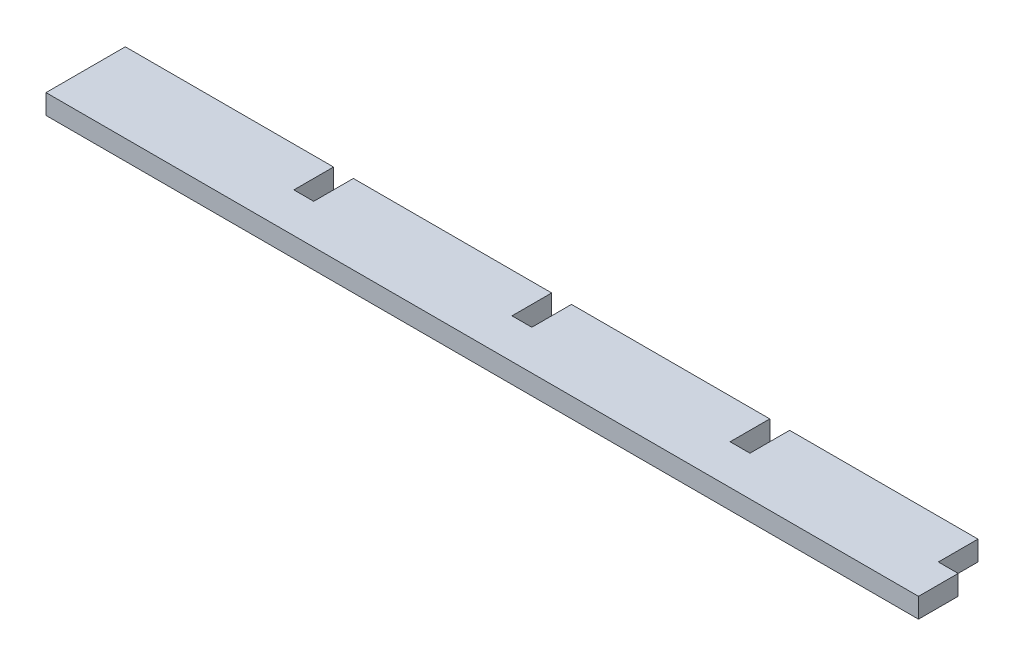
ISO-10303-21;
HEADER;
FILE_DESCRIPTION(('STEP AP214'),'2;1');
FILE_NAME('part.step','',(''),(''),'','','');
FILE_SCHEMA(('AUTOMOTIVE_DESIGN { 1 0 10303 214 1 1 1 1 }'));
ENDSEC;
DATA;
#1=APPLICATION_CONTEXT('core data for automotive mechanical design processes');
#2=APPLICATION_PROTOCOL_DEFINITION('international standard','automotive_design',2000,#1);
#3=PRODUCT_CONTEXT('',#1,'mechanical');
#4=PRODUCT('Part','Part','',(#3));
#5=PRODUCT_RELATED_PRODUCT_CATEGORY('part','',(#4));
#6=PRODUCT_DEFINITION_FORMATION('','',#4);
#7=PRODUCT_DEFINITION_CONTEXT('part definition',#1,'design');
#8=PRODUCT_DEFINITION('design','',#6,#7);
#9=PRODUCT_DEFINITION_SHAPE('','',#8);
#10=(LENGTH_UNIT() NAMED_UNIT(*) SI_UNIT(.MILLI.,.METRE.));
#11=(NAMED_UNIT(*) PLANE_ANGLE_UNIT() SI_UNIT($,.RADIAN.));
#12=(NAMED_UNIT(*) SI_UNIT($,.STERADIAN.) SOLID_ANGLE_UNIT());
#13=UNCERTAINTY_MEASURE_WITH_UNIT(LENGTH_MEASURE(1.E-05),#10,'distance_accuracy_value','');
#14=(GEOMETRIC_REPRESENTATION_CONTEXT(3) GLOBAL_UNCERTAINTY_ASSIGNED_CONTEXT((#13)) GLOBAL_UNIT_ASSIGNED_CONTEXT((#10,
#11,#12)) REPRESENTATION_CONTEXT('',''));
#15=CARTESIAN_POINT('',(0.,0.,0.));
#16=DIRECTION('',(0.,0.,1.));
#17=DIRECTION('',(1.,0.,0.));
#18=AXIS2_PLACEMENT_3D('',#15,#16,#17);
#19=CARTESIAN_POINT('',(0.,6.35,-25.4000000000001));
#20=DIRECTION('',(0.,0.,1.));
#21=DIRECTION('',(1.,0.,0.));
#22=AXIS2_PLACEMENT_3D('',#19,#20,#21);
#23=PLANE('',#22);
#24=DIRECTION('',(-1.,0.,0.));
#25=VECTOR('',#24,1.);
#26=CARTESIAN_POINT('',(0.,0.,-25.4000000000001));
#27=LINE('',#26,#25);
#28=CARTESIAN_POINT('',(-142.875,0.,-25.4));
#29=VERTEX_POINT('',#28);
#30=CARTESIAN_POINT('',(-206.375,0.,-25.4));
#31=VERTEX_POINT('',#30);
#32=EDGE_CURVE('E194',#29,#31,#27,.T.);
#33=ORIENTED_EDGE('',*,*,#32,.T.);
#34=DIRECTION('',(0.,-1.,0.));
#35=VECTOR('',#34,1.);
#36=CARTESIAN_POINT('',(-206.375,6.35,-25.4));
#37=LINE('',#36,#35);
#38=CARTESIAN_POINT('',(-206.375,6.35,-25.4));
#39=VERTEX_POINT('',#38);
#40=EDGE_CURVE('E11',#39,#31,#37,.T.);
#41=ORIENTED_EDGE('',*,*,#40,.F.);
#42=DIRECTION('',(-1.,0.,0.));
#43=VECTOR('',#42,1.);
#44=CARTESIAN_POINT('',(0.,6.35,-25.4000000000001));
#45=LINE('',#44,#43);
#46=CARTESIAN_POINT('',(-142.875,6.35,-25.4));
#47=VERTEX_POINT('',#46);
#48=EDGE_CURVE('E238',#47,#39,#45,.T.);
#49=ORIENTED_EDGE('',*,*,#48,.F.);
#50=DIRECTION('',(0.,-1.,0.));
#51=VECTOR('',#50,1.);
#52=CARTESIAN_POINT('',(-142.875,6.35,-25.4));
#53=LINE('',#52,#51);
#54=EDGE_CURVE('E52',#47,#29,#53,.T.);
#55=ORIENTED_EDGE('',*,*,#54,.T.);
#56=EDGE_LOOP('',(#33,#41,#49,#55));
#57=FACE_BOUND('',#56,.T.);
#58=ADVANCED_FACE('F35',(#57),#23,.F.);
#59=CARTESIAN_POINT('',(-206.375,6.35,0.));
#60=DIRECTION('',(1.,0.,0.));
#61=DIRECTION('',(0.,0.,-1.));
#62=AXIS2_PLACEMENT_3D('',#59,#60,#61);
#63=PLANE('',#62);
#64=DIRECTION('',(0.,0.,1.));
#65=VECTOR('',#64,1.);
#66=CARTESIAN_POINT('',(-206.375,0.,0.));
#67=LINE('',#66,#65);
#68=CARTESIAN_POINT('',(-206.375,0.,-12.7));
#69=VERTEX_POINT('',#68);
#70=EDGE_CURVE('E196',#31,#69,#67,.T.);
#71=ORIENTED_EDGE('',*,*,#70,.T.);
#72=DIRECTION('',(0.,-1.,0.));
#73=VECTOR('',#72,1.);
#74=CARTESIAN_POINT('',(-206.375,6.35,-12.7));
#75=LINE('',#74,#73);
#76=CARTESIAN_POINT('',(-206.375,6.35,-12.7));
#77=VERTEX_POINT('',#76);
#78=EDGE_CURVE('E44',#77,#69,#75,.T.);
#79=ORIENTED_EDGE('',*,*,#78,.F.);
#80=DIRECTION('',(0.,0.,1.));
#81=VECTOR('',#80,1.);
#82=CARTESIAN_POINT('',(-206.375,6.35,0.));
#83=LINE('',#82,#81);
#84=EDGE_CURVE('E120',#39,#77,#83,.T.);
#85=ORIENTED_EDGE('',*,*,#84,.F.);
#86=ORIENTED_EDGE('',*,*,#40,.T.);
#87=EDGE_LOOP('',(#71,#79,#85,#86));
#88=FACE_BOUND('',#87,.T.);
#89=ADVANCED_FACE('F37',(#88),#63,.F.);
#90=CARTESIAN_POINT('',(0.,6.35,-12.7));
#91=DIRECTION('',(0.,0.,-1.));
#92=DIRECTION('',(-1.,0.,0.));
#93=AXIS2_PLACEMENT_3D('',#90,#91,#92);
#94=PLANE('',#93);
#95=DIRECTION('',(1.,0.,0.));
#96=VECTOR('',#95,1.);
#97=CARTESIAN_POINT('',(0.,0.,-12.7));
#98=LINE('',#97,#96);
#99=CARTESIAN_POINT('',(-212.725,0.,-12.7));
#100=VERTEX_POINT('',#99);
#101=EDGE_CURVE('E201',#100,#69,#98,.T.);
#102=ORIENTED_EDGE('',*,*,#101,.F.);
#103=DIRECTION('',(0.,-1.,0.));
#104=VECTOR('',#103,1.);
#105=CARTESIAN_POINT('',(-212.725,6.35,-12.7));
#106=LINE('',#105,#104);
#107=CARTESIAN_POINT('',(-212.725,6.35,-12.7));
#108=VERTEX_POINT('',#107);
#109=EDGE_CURVE('E265',#108,#100,#106,.T.);
#110=ORIENTED_EDGE('',*,*,#109,.F.);
#111=DIRECTION('',(1.,0.,0.));
#112=VECTOR('',#111,1.);
#113=CARTESIAN_POINT('',(0.,6.35,-12.7));
#114=LINE('',#113,#112);
#115=EDGE_CURVE('E271',#108,#77,#114,.T.);
#116=ORIENTED_EDGE('',*,*,#115,.T.);
#117=ORIENTED_EDGE('',*,*,#78,.T.);
#118=EDGE_LOOP('',(#102,#110,#116,#117));
#119=FACE_BOUND('',#118,.T.);
#120=ADVANCED_FACE('F269',(#119),#94,.T.);
#121=CARTESIAN_POINT('',(-212.725,6.35,0.));
#122=DIRECTION('',(1.,0.,0.));
#123=DIRECTION('',(0.,0.,-1.));
#124=AXIS2_PLACEMENT_3D('',#121,#122,#123);
#125=PLANE('',#124);
#126=DIRECTION('',(0.,0.,1.));
#127=VECTOR('',#126,1.);
#128=CARTESIAN_POINT('',(-212.725,0.,0.));
#129=LINE('',#128,#127);
#130=CARTESIAN_POINT('',(-212.725,0.,-25.4));
#131=VERTEX_POINT('',#130);
#132=EDGE_CURVE('E204',#131,#100,#129,.T.);
#133=ORIENTED_EDGE('',*,*,#132,.F.);
#134=DIRECTION('',(0.,-1.,0.));
#135=VECTOR('',#134,1.);
#136=CARTESIAN_POINT('',(-212.725,6.35,-25.4));
#137=LINE('',#136,#135);
#138=CARTESIAN_POINT('',(-212.725,6.35,-25.4));
#139=VERTEX_POINT('',#138);
#140=EDGE_CURVE('E263',#139,#131,#137,.T.);
#141=ORIENTED_EDGE('',*,*,#140,.F.);
#142=DIRECTION('',(0.,0.,1.));
#143=VECTOR('',#142,1.);
#144=CARTESIAN_POINT('',(-212.725,6.35,0.));
#145=LINE('',#144,#143);
#146=EDGE_CURVE('E283',#139,#108,#145,.T.);
#147=ORIENTED_EDGE('',*,*,#146,.T.);
#148=ORIENTED_EDGE('',*,*,#109,.T.);
#149=EDGE_LOOP('',(#133,#141,#147,#148));
#150=FACE_BOUND('',#149,.T.);
#151=ADVANCED_FACE('F279',(#150),#125,.T.);
#152=CARTESIAN_POINT('',(-279.4,0.,-25.4));
#153=VERTEX_POINT('',#152);
#154=EDGE_CURVE('E198',#131,#153,#27,.T.);
#155=ORIENTED_EDGE('',*,*,#154,.T.);
#156=DIRECTION('',(0.,-1.,0.));
#157=VECTOR('',#156,1.);
#158=CARTESIAN_POINT('',(-279.4,6.35,-25.4));
#159=LINE('',#158,#157);
#160=CARTESIAN_POINT('',(-279.4,6.35,-25.4));
#161=VERTEX_POINT('',#160);
#162=EDGE_CURVE('E261',#161,#153,#159,.T.);
#163=ORIENTED_EDGE('',*,*,#162,.F.);
#164=EDGE_CURVE('E285',#139,#161,#45,.T.);
#165=ORIENTED_EDGE('',*,*,#164,.F.);
#166=ORIENTED_EDGE('',*,*,#140,.T.);
#167=EDGE_LOOP('',(#155,#163,#165,#166));
#168=FACE_BOUND('',#167,.T.);
#169=ADVANCED_FACE('F316',(#168),#23,.F.);
#170=CARTESIAN_POINT('',(-279.4,6.35,0.));
#171=DIRECTION('',(-1.,0.,0.));
#172=DIRECTION('',(0.,0.,1.));
#173=AXIS2_PLACEMENT_3D('',#170,#171,#172);
#174=PLANE('',#173);
#175=DIRECTION('',(0.,0.,-1.));
#176=VECTOR('',#175,1.);
#177=CARTESIAN_POINT('',(-279.4,0.,0.));
#178=LINE('',#177,#176);
#179=CARTESIAN_POINT('',(-279.4,0.,0.));
#180=VERTEX_POINT('',#179);
#181=EDGE_CURVE('E207',#180,#153,#178,.T.);
#182=ORIENTED_EDGE('',*,*,#181,.F.);
#183=DIRECTION('',(0.,-1.,0.));
#184=VECTOR('',#183,1.);
#185=CARTESIAN_POINT('',(-279.4,6.35,0.));
#186=LINE('',#185,#184);
#187=CARTESIAN_POINT('',(-279.4,6.35,0.));
#188=VERTEX_POINT('',#187);
#189=EDGE_CURVE('E259',#188,#180,#186,.T.);
#190=ORIENTED_EDGE('',*,*,#189,.F.);
#191=DIRECTION('',(0.,0.,-1.));
#192=VECTOR('',#191,1.);
#193=CARTESIAN_POINT('',(-279.4,6.35,0.));
#194=LINE('',#193,#192);
#195=EDGE_CURVE('E290',#188,#161,#194,.T.);
#196=ORIENTED_EDGE('',*,*,#195,.T.);
#197=ORIENTED_EDGE('',*,*,#162,.T.);
#198=EDGE_LOOP('',(#182,#190,#196,#197));
#199=FACE_BOUND('',#198,.T.);
#200=ADVANCED_FACE('F319',(#199),#174,.T.);
#201=CARTESIAN_POINT('',(0.,6.35,0.));
#202=DIRECTION('',(0.,0.,1.));
#203=DIRECTION('',(1.,0.,0.));
#204=AXIS2_PLACEMENT_3D('',#201,#202,#203);
#205=PLANE('',#204);
#206=DIRECTION('',(-1.,0.,0.));
#207=VECTOR('',#206,1.);
#208=CARTESIAN_POINT('',(0.,0.,0.));
#209=LINE('',#208,#207);
#210=CARTESIAN_POINT('',(0.,0.,0.));
#211=VERTEX_POINT('',#210);
#212=EDGE_CURVE('E210',#211,#180,#209,.T.);
#213=ORIENTED_EDGE('',*,*,#212,.F.);
#214=DIRECTION('',(0.,-1.,0.));
#215=VECTOR('',#214,1.);
#216=CARTESIAN_POINT('',(0.,6.35,0.));
#217=LINE('',#216,#215);
#218=CARTESIAN_POINT('',(0.,6.35,0.));
#219=VERTEX_POINT('',#218);
#220=EDGE_CURVE('E257',#219,#211,#217,.T.);
#221=ORIENTED_EDGE('',*,*,#220,.F.);
#222=DIRECTION('',(-1.,0.,0.));
#223=VECTOR('',#222,1.);
#224=CARTESIAN_POINT('',(0.,6.35,0.));
#225=LINE('',#224,#223);
#226=EDGE_CURVE('E293',#219,#188,#225,.T.);
#227=ORIENTED_EDGE('',*,*,#226,.T.);
#228=ORIENTED_EDGE('',*,*,#189,.T.);
#229=EDGE_LOOP('',(#213,#221,#227,#228));
#230=FACE_BOUND('',#229,.T.);
#231=ADVANCED_FACE('F322',(#230),#205,.T.);
#232=CARTESIAN_POINT('',(0.,6.35,0.));
#233=DIRECTION('',(-1.,0.,0.));
#234=DIRECTION('',(0.,0.,1.));
#235=AXIS2_PLACEMENT_3D('',#232,#233,#234);
#236=PLANE('',#235);
#237=DIRECTION('',(0.,0.,-1.));
#238=VECTOR('',#237,1.);
#239=CARTESIAN_POINT('',(0.,0.,0.));
#240=LINE('',#239,#238);
#241=CARTESIAN_POINT('',(0.,0.,-12.7));
#242=VERTEX_POINT('',#241);
#243=EDGE_CURVE('E213',#211,#242,#240,.T.);
#244=ORIENTED_EDGE('',*,*,#243,.T.);
#245=DIRECTION('',(0.,-1.,0.));
#246=VECTOR('',#245,1.);
#247=CARTESIAN_POINT('',(0.,6.35,-12.7));
#248=LINE('',#247,#246);
#249=CARTESIAN_POINT('',(0.,6.35,-12.7));
#250=VERTEX_POINT('',#249);
#251=EDGE_CURVE('E255',#250,#242,#248,.T.);
#252=ORIENTED_EDGE('',*,*,#251,.F.);
#253=DIRECTION('',(0.,0.,-1.));
#254=VECTOR('',#253,1.);
#255=CARTESIAN_POINT('',(0.,6.35,0.));
#256=LINE('',#255,#254);
#257=EDGE_CURVE('E296',#219,#250,#256,.T.);
#258=ORIENTED_EDGE('',*,*,#257,.F.);
#259=ORIENTED_EDGE('',*,*,#220,.T.);
#260=EDGE_LOOP('',(#244,#252,#258,#259));
#261=FACE_BOUND('',#260,.T.);
#262=ADVANCED_FACE('F328',(#261),#236,.F.);
#263=CARTESIAN_POINT('',(0.,6.35,-12.7));
#264=DIRECTION('',(0.,0.,-1.));
#265=DIRECTION('',(-1.,0.,0.));
#266=AXIS2_PLACEMENT_3D('',#263,#264,#265);
#267=PLANE('',#266);
#268=DIRECTION('',(1.,0.,0.));
#269=VECTOR('',#268,1.);
#270=CARTESIAN_POINT('',(0.,0.,-12.7));
#271=LINE('',#270,#269);
#272=CARTESIAN_POINT('',(-6.35,0.,-12.7));
#273=VERTEX_POINT('',#272);
#274=EDGE_CURVE('E216',#273,#242,#271,.T.);
#275=ORIENTED_EDGE('',*,*,#274,.F.);
#276=DIRECTION('',(0.,-1.,0.));
#277=VECTOR('',#276,1.);
#278=CARTESIAN_POINT('',(-6.35,6.35,-12.7));
#279=LINE('',#278,#277);
#280=CARTESIAN_POINT('',(-6.35,6.35,-12.7));
#281=VERTEX_POINT('',#280);
#282=EDGE_CURVE('E253',#281,#273,#279,.T.);
#283=ORIENTED_EDGE('',*,*,#282,.F.);
#284=DIRECTION('',(1.,0.,0.));
#285=VECTOR('',#284,1.);
#286=CARTESIAN_POINT('',(0.,6.35,-12.7));
#287=LINE('',#286,#285);
#288=EDGE_CURVE('E298',#281,#250,#287,.T.);
#289=ORIENTED_EDGE('',*,*,#288,.T.);
#290=ORIENTED_EDGE('',*,*,#251,.T.);
#291=EDGE_LOOP('',(#275,#283,#289,#290));
#292=FACE_BOUND('',#291,.T.);
#293=ADVANCED_FACE('F332',(#292),#267,.T.);
#294=CARTESIAN_POINT('',(-6.35,6.35,0.));
#295=DIRECTION('',(1.,0.,0.));
#296=DIRECTION('',(0.,0.,-1.));
#297=AXIS2_PLACEMENT_3D('',#294,#295,#296);
#298=PLANE('',#297);
#299=DIRECTION('',(0.,0.,1.));
#300=VECTOR('',#299,1.);
#301=CARTESIAN_POINT('',(-6.35,0.,0.));
#302=LINE('',#301,#300);
#303=CARTESIAN_POINT('',(-6.35,0.,-25.4000000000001));
#304=VERTEX_POINT('',#303);
#305=EDGE_CURVE('E219',#304,#273,#302,.T.);
#306=ORIENTED_EDGE('',*,*,#305,.F.);
#307=DIRECTION('',(0.,-1.,0.));
#308=VECTOR('',#307,1.);
#309=CARTESIAN_POINT('',(-6.35,6.35,-25.4000000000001));
#310=LINE('',#309,#308);
#311=CARTESIAN_POINT('',(-6.35,6.35,-25.4000000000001));
#312=VERTEX_POINT('',#311);
#313=EDGE_CURVE('E251',#312,#304,#310,.T.);
#314=ORIENTED_EDGE('',*,*,#313,.F.);
#315=DIRECTION('',(0.,0.,1.));
#316=VECTOR('',#315,1.);
#317=CARTESIAN_POINT('',(-6.35,6.35,0.));
#318=LINE('',#317,#316);
#319=EDGE_CURVE('E301',#312,#281,#318,.T.);
#320=ORIENTED_EDGE('',*,*,#319,.T.);
#321=ORIENTED_EDGE('',*,*,#282,.T.);
#322=EDGE_LOOP('',(#306,#314,#320,#321));
#323=FACE_BOUND('',#322,.T.);
#324=ADVANCED_FACE('F335',(#323),#298,.T.);
#325=CARTESIAN_POINT('',(-66.675,0.,-25.4));
#326=VERTEX_POINT('',#325);
#327=EDGE_CURVE('E222',#304,#326,#27,.T.);
#328=ORIENTED_EDGE('',*,*,#327,.T.);
#329=DIRECTION('',(0.,-1.,0.));
#330=VECTOR('',#329,1.);
#331=CARTESIAN_POINT('',(-66.675,6.35,-25.4));
#332=LINE('',#331,#330);
#333=CARTESIAN_POINT('',(-66.675,6.35,-25.4));
#334=VERTEX_POINT('',#333);
#335=EDGE_CURVE('E248',#334,#326,#332,.T.);
#336=ORIENTED_EDGE('',*,*,#335,.F.);
#337=EDGE_CURVE('E304',#312,#334,#45,.T.);
#338=ORIENTED_EDGE('',*,*,#337,.F.);
#339=ORIENTED_EDGE('',*,*,#313,.T.);
#340=EDGE_LOOP('',(#328,#336,#338,#339));
#341=FACE_BOUND('',#340,.T.);
#342=ADVANCED_FACE('F342',(#341),#23,.F.);
#343=CARTESIAN_POINT('',(-66.675,6.35,0.));
#344=DIRECTION('',(1.,0.,0.));
#345=DIRECTION('',(0.,0.,-1.));
#346=AXIS2_PLACEMENT_3D('',#343,#344,#345);
#347=PLANE('',#346);
#348=DIRECTION('',(0.,0.,1.));
#349=VECTOR('',#348,1.);
#350=CARTESIAN_POINT('',(-66.675,0.,0.));
#351=LINE('',#350,#349);
#352=CARTESIAN_POINT('',(-66.675,0.,-12.7));
#353=VERTEX_POINT('',#352);
#354=EDGE_CURVE('E223',#326,#353,#351,.T.);
#355=ORIENTED_EDGE('',*,*,#354,.T.);
#356=DIRECTION('',(0.,-1.,0.));
#357=VECTOR('',#356,1.);
#358=CARTESIAN_POINT('',(-66.675,6.35,-12.7));
#359=LINE('',#358,#357);
#360=CARTESIAN_POINT('',(-66.675,6.35,-12.7));
#361=VERTEX_POINT('',#360);
#362=EDGE_CURVE('E246',#361,#353,#359,.T.);
#363=ORIENTED_EDGE('',*,*,#362,.F.);
#364=DIRECTION('',(0.,0.,1.));
#365=VECTOR('',#364,1.);
#366=CARTESIAN_POINT('',(-66.675,6.35,0.));
#367=LINE('',#366,#365);
#368=EDGE_CURVE('E305',#334,#361,#367,.T.);
#369=ORIENTED_EDGE('',*,*,#368,.F.);
#370=ORIENTED_EDGE('',*,*,#335,.T.);
#371=EDGE_LOOP('',(#355,#363,#369,#370));
#372=FACE_BOUND('',#371,.T.);
#373=ADVANCED_FACE('F346',(#372),#347,.F.);
#374=CARTESIAN_POINT('',(0.,6.35,-12.7));
#375=DIRECTION('',(0.,0.,-1.));
#376=DIRECTION('',(-1.,0.,0.));
#377=AXIS2_PLACEMENT_3D('',#374,#375,#376);
#378=PLANE('',#377);
#379=DIRECTION('',(1.,0.,0.));
#380=VECTOR('',#379,1.);
#381=CARTESIAN_POINT('',(0.,0.,-12.7));
#382=LINE('',#381,#380);
#383=CARTESIAN_POINT('',(-73.025,0.,-12.7));
#384=VERTEX_POINT('',#383);
#385=EDGE_CURVE('E226',#384,#353,#382,.T.);
#386=ORIENTED_EDGE('',*,*,#385,.F.);
#387=DIRECTION('',(0.,-1.,0.));
#388=VECTOR('',#387,1.);
#389=CARTESIAN_POINT('',(-73.025,6.35,-12.7));
#390=LINE('',#389,#388);
#391=CARTESIAN_POINT('',(-73.025,6.35,-12.7));
#392=VERTEX_POINT('',#391);
#393=EDGE_CURVE('E244',#392,#384,#390,.T.);
#394=ORIENTED_EDGE('',*,*,#393,.F.);
#395=DIRECTION('',(1.,0.,0.));
#396=VECTOR('',#395,1.);
#397=CARTESIAN_POINT('',(0.,6.35,-12.7));
#398=LINE('',#397,#396);
#399=EDGE_CURVE('E307',#392,#361,#398,.T.);
#400=ORIENTED_EDGE('',*,*,#399,.T.);
#401=ORIENTED_EDGE('',*,*,#362,.T.);
#402=EDGE_LOOP('',(#386,#394,#400,#401));
#403=FACE_BOUND('',#402,.T.);
#404=ADVANCED_FACE('F349',(#403),#378,.T.);
#405=CARTESIAN_POINT('',(-73.025,6.35,0.));
#406=DIRECTION('',(1.,0.,0.));
#407=DIRECTION('',(0.,0.,-1.));
#408=AXIS2_PLACEMENT_3D('',#405,#406,#407);
#409=PLANE('',#408);
#410=DIRECTION('',(0.,0.,1.));
#411=VECTOR('',#410,1.);
#412=CARTESIAN_POINT('',(-73.025,0.,0.));
#413=LINE('',#412,#411);
#414=CARTESIAN_POINT('',(-73.025,0.,-25.4));
#415=VERTEX_POINT('',#414);
#416=EDGE_CURVE('E229',#415,#384,#413,.T.);
#417=ORIENTED_EDGE('',*,*,#416,.F.);
#418=DIRECTION('',(0.,-1.,0.));
#419=VECTOR('',#418,1.);
#420=CARTESIAN_POINT('',(-73.025,6.35,-25.4));
#421=LINE('',#420,#419);
#422=CARTESIAN_POINT('',(-73.025,6.35,-25.4));
#423=VERTEX_POINT('',#422);
#424=EDGE_CURVE('E242',#423,#415,#421,.T.);
#425=ORIENTED_EDGE('',*,*,#424,.F.);
#426=DIRECTION('',(0.,0.,1.));
#427=VECTOR('',#426,1.);
#428=CARTESIAN_POINT('',(-73.025,6.35,0.));
#429=LINE('',#428,#427);
#430=EDGE_CURVE('E309',#423,#392,#429,.T.);
#431=ORIENTED_EDGE('',*,*,#430,.T.);
#432=ORIENTED_EDGE('',*,*,#393,.T.);
#433=EDGE_LOOP('',(#417,#425,#431,#432));
#434=FACE_BOUND('',#433,.T.);
#435=ADVANCED_FACE('F351',(#434),#409,.T.);
#436=CARTESIAN_POINT('',(-136.525,0.,-25.4));
#437=VERTEX_POINT('',#436);
#438=EDGE_CURVE('E197',#415,#437,#27,.T.);
#439=ORIENTED_EDGE('',*,*,#438,.T.);
#440=DIRECTION('',(0.,-1.,0.));
#441=VECTOR('',#440,1.);
#442=CARTESIAN_POINT('',(-136.525,6.35,-25.4));
#443=LINE('',#442,#441);
#444=CARTESIAN_POINT('',(-136.525,6.35,-25.4));
#445=VERTEX_POINT('',#444);
#446=EDGE_CURVE('E186',#445,#437,#443,.T.);
#447=ORIENTED_EDGE('',*,*,#446,.F.);
#448=EDGE_CURVE('E174',#423,#445,#45,.T.);
#449=ORIENTED_EDGE('',*,*,#448,.F.);
#450=ORIENTED_EDGE('',*,*,#424,.T.);
#451=EDGE_LOOP('',(#439,#447,#449,#450));
#452=FACE_BOUND('',#451,.T.);
#453=ADVANCED_FACE('F354',(#452),#23,.F.);
#454=CARTESIAN_POINT('',(-136.525,6.35,0.));
#455=DIRECTION('',(1.,0.,0.));
#456=DIRECTION('',(0.,0.,-1.));
#457=AXIS2_PLACEMENT_3D('',#454,#455,#456);
#458=PLANE('',#457);
#459=DIRECTION('',(0.,0.,1.));
#460=VECTOR('',#459,1.);
#461=CARTESIAN_POINT('',(-136.525,0.,0.));
#462=LINE('',#461,#460);
#463=CARTESIAN_POINT('',(-136.525,0.,-12.7));
#464=VERTEX_POINT('',#463);
#465=EDGE_CURVE('E183',#437,#464,#462,.T.);
#466=ORIENTED_EDGE('',*,*,#465,.T.);
#467=DIRECTION('',(0.,-1.,0.));
#468=VECTOR('',#467,1.);
#469=CARTESIAN_POINT('',(-136.525,6.35,-12.7));
#470=LINE('',#469,#468);
#471=CARTESIAN_POINT('',(-136.525,6.35,-12.7));
#472=VERTEX_POINT('',#471);
#473=EDGE_CURVE('E180',#472,#464,#470,.T.);
#474=ORIENTED_EDGE('',*,*,#473,.F.);
#475=DIRECTION('',(0.,0.,1.));
#476=VECTOR('',#475,1.);
#477=CARTESIAN_POINT('',(-136.525,6.35,0.));
#478=LINE('',#477,#476);
#479=EDGE_CURVE('E166',#445,#472,#478,.T.);
#480=ORIENTED_EDGE('',*,*,#479,.F.);
#481=ORIENTED_EDGE('',*,*,#446,.T.);
#482=EDGE_LOOP('',(#466,#474,#480,#481));
#483=FACE_BOUND('',#482,.T.);
#484=ADVANCED_FACE('F181',(#483),#458,.F.);
#485=CARTESIAN_POINT('',(0.,6.35,-12.7));
#486=DIRECTION('',(0.,0.,-1.));
#487=DIRECTION('',(-1.,0.,0.));
#488=AXIS2_PLACEMENT_3D('',#485,#486,#487);
#489=PLANE('',#488);
#490=DIRECTION('',(1.,0.,0.));
#491=VECTOR('',#490,1.);
#492=CARTESIAN_POINT('',(0.,0.,-12.7));
#493=LINE('',#492,#491);
#494=CARTESIAN_POINT('',(-142.875,0.,-12.7));
#495=VERTEX_POINT('',#494);
#496=EDGE_CURVE('E233',#495,#464,#493,.T.);
#497=ORIENTED_EDGE('',*,*,#496,.F.);
#498=DIRECTION('',(0.,-1.,0.));
#499=VECTOR('',#498,1.);
#500=CARTESIAN_POINT('',(-142.875,6.35,-12.7));
#501=LINE('',#500,#499);
#502=CARTESIAN_POINT('',(-142.875,6.35,-12.7));
#503=VERTEX_POINT('',#502);
#504=EDGE_CURVE('E108',#503,#495,#501,.T.);
#505=ORIENTED_EDGE('',*,*,#504,.F.);
#506=DIRECTION('',(1.,0.,0.));
#507=VECTOR('',#506,1.);
#508=CARTESIAN_POINT('',(0.,6.35,-12.7));
#509=LINE('',#508,#507);
#510=EDGE_CURVE('E171',#503,#472,#509,.T.);
#511=ORIENTED_EDGE('',*,*,#510,.T.);
#512=ORIENTED_EDGE('',*,*,#473,.T.);
#513=EDGE_LOOP('',(#497,#505,#511,#512));
#514=FACE_BOUND('',#513,.T.);
#515=ADVANCED_FACE('F188',(#514),#489,.T.);
#516=CARTESIAN_POINT('',(-142.875,6.35,0.));
#517=DIRECTION('',(1.,0.,0.));
#518=DIRECTION('',(0.,0.,-1.));
#519=AXIS2_PLACEMENT_3D('',#516,#517,#518);
#520=PLANE('',#519);
#521=DIRECTION('',(0.,0.,1.));
#522=VECTOR('',#521,1.);
#523=CARTESIAN_POINT('',(-142.875,0.,0.));
#524=LINE('',#523,#522);
#525=EDGE_CURVE('E235',#29,#495,#524,.T.);
#526=ORIENTED_EDGE('',*,*,#525,.F.);
#527=ORIENTED_EDGE('',*,*,#54,.F.);
#528=DIRECTION('',(0.,0.,1.));
#529=VECTOR('',#528,1.);
#530=CARTESIAN_POINT('',(-142.875,6.35,0.));
#531=LINE('',#530,#529);
#532=EDGE_CURVE('E189',#47,#503,#531,.T.);
#533=ORIENTED_EDGE('',*,*,#532,.T.);
#534=ORIENTED_EDGE('',*,*,#504,.T.);
#535=EDGE_LOOP('',(#526,#527,#533,#534));
#536=FACE_BOUND('',#535,.T.);
#537=ADVANCED_FACE('F416',(#536),#520,.T.);
#538=CARTESIAN_POINT('',(0.,6.35,0.));
#539=DIRECTION('',(0.,1.,0.));
#540=DIRECTION('',(0.,0.,1.));
#541=AXIS2_PLACEMENT_3D('',#538,#539,#540);
#542=PLANE('',#541);
#543=ORIENTED_EDGE('',*,*,#48,.T.);
#544=ORIENTED_EDGE('',*,*,#84,.T.);
#545=ORIENTED_EDGE('',*,*,#115,.F.);
#546=ORIENTED_EDGE('',*,*,#146,.F.);
#547=ORIENTED_EDGE('',*,*,#164,.T.);
#548=ORIENTED_EDGE('',*,*,#195,.F.);
#549=ORIENTED_EDGE('',*,*,#226,.F.);
#550=ORIENTED_EDGE('',*,*,#257,.T.);
#551=ORIENTED_EDGE('',*,*,#288,.F.);
#552=ORIENTED_EDGE('',*,*,#319,.F.);
#553=ORIENTED_EDGE('',*,*,#337,.T.);
#554=ORIENTED_EDGE('',*,*,#368,.T.);
#555=ORIENTED_EDGE('',*,*,#399,.F.);
#556=ORIENTED_EDGE('',*,*,#430,.F.);
#557=ORIENTED_EDGE('',*,*,#448,.T.);
#558=ORIENTED_EDGE('',*,*,#479,.T.);
#559=ORIENTED_EDGE('',*,*,#510,.F.);
#560=ORIENTED_EDGE('',*,*,#532,.F.);
#561=EDGE_LOOP('',(#543,#544,#545,#546,#547,#548,#549,#550,#551,#552,#553,#554,#555,#556,#557,
#558,#559,#560));
#562=FACE_BOUND('',#561,.T.);
#563=ADVANCED_FACE('F168',(#562),#542,.T.);
#564=CARTESIAN_POINT('',(0.,0.,0.));
#565=DIRECTION('',(0.,1.,0.));
#566=DIRECTION('',(0.,0.,1.));
#567=AXIS2_PLACEMENT_3D('',#564,#565,#566);
#568=PLANE('',#567);
#569=ORIENTED_EDGE('',*,*,#32,.F.);
#570=ORIENTED_EDGE('',*,*,#525,.T.);
#571=ORIENTED_EDGE('',*,*,#496,.T.);
#572=ORIENTED_EDGE('',*,*,#465,.F.);
#573=ORIENTED_EDGE('',*,*,#438,.F.);
#574=ORIENTED_EDGE('',*,*,#416,.T.);
#575=ORIENTED_EDGE('',*,*,#385,.T.);
#576=ORIENTED_EDGE('',*,*,#354,.F.);
#577=ORIENTED_EDGE('',*,*,#327,.F.);
#578=ORIENTED_EDGE('',*,*,#305,.T.);
#579=ORIENTED_EDGE('',*,*,#274,.T.);
#580=ORIENTED_EDGE('',*,*,#243,.F.);
#581=ORIENTED_EDGE('',*,*,#212,.T.);
#582=ORIENTED_EDGE('',*,*,#181,.T.);
#583=ORIENTED_EDGE('',*,*,#154,.F.);
#584=ORIENTED_EDGE('',*,*,#132,.T.);
#585=ORIENTED_EDGE('',*,*,#101,.T.);
#586=ORIENTED_EDGE('',*,*,#70,.F.);
#587=EDGE_LOOP('',(#569,#570,#571,#572,#573,#574,#575,#576,#577,#578,#579,#580,#581,#582,#583,
#584,#585,#586));
#588=FACE_BOUND('',#587,.T.);
#589=ADVANCED_FACE('F274',(#588),#568,.F.);
#590=CLOSED_SHELL('',(#58,#89,#120,#151,#169,#200,#231,#262,#293,#324,#342,#373,#404,#435,#453,
#484,#515,#537,#563,#589));
#591=MANIFOLD_SOLID_BREP('B2',#590);
#592=ADVANCED_BREP_SHAPE_REPRESENTATION('',(#18,#591),#14);
#593=SHAPE_DEFINITION_REPRESENTATION(#9,#592);
ENDSEC;
END-ISO-10303-21;
